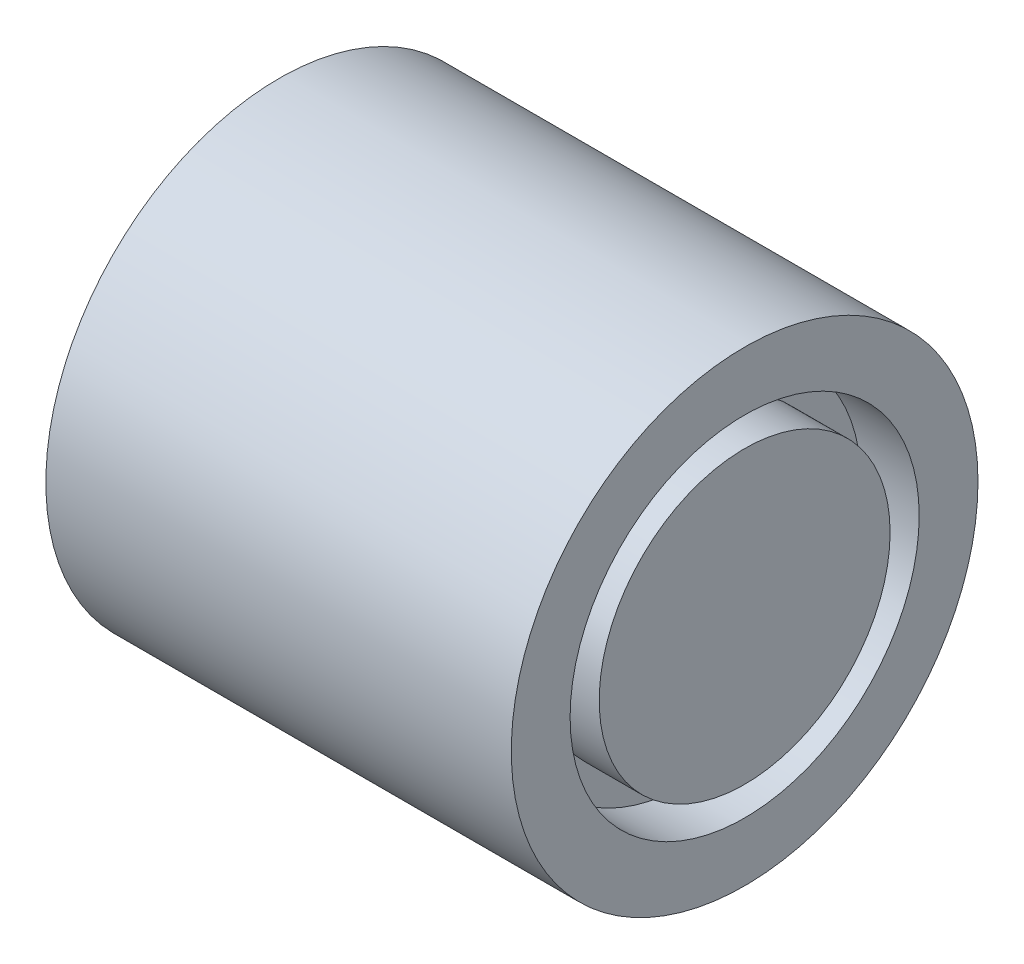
from build123d import *

# Parameters (mm, degrees)
SKETCH2_R          = 19.05
SKETCH2_R_2        = 15.875
CUT_EXTRUDE1_DEPTH = 6.35
CUT_EXTRUDE2_START = -6.35
SKETCH3_R          = 19.05
SKETCH3_R_2        = 15.875
CUT_EXTRUDE2_DEPTH = 6.35


with BuildPart() as part:
    # Sketch1 → Revolve1 (revolve)
    with BuildSketch(Plane.XY, mode=Mode.PRIVATE) as revolve1_sk:
        Polygon((0, 0.068518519), (0, 25.468518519), (-50.8, 25.468518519), (-50.8, 0), (0, 0), align=None)
    revolve(revolve1_sk.sketch.rotate(Axis((11.589606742, 0, 0), (-1, 0, 0)), 90), axis=Axis((11.589606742, 0, 0), (-1, 0, 0)))

    # Sketch2 → Cut-Extrude1 (cut)
    with BuildSketch(Plane(origin=(0, 0, 0), x_dir=(0, 0, -1), z_dir=(1, 0, 0))):
        Circle(SKETCH2_R)
        Circle(SKETCH2_R_2, mode=Mode.SUBTRACT)
    extrude(amount=-CUT_EXTRUDE1_DEPTH, mode=Mode.SUBTRACT)

    # Sketch3 → Cut-Extrude2 (cut)
    with BuildSketch(Plane.ZY.offset(50.8).offset(CUT_EXTRUDE2_START)):
        with Locations(Location((0, 0, 0), (0, 0, 180))):
            Circle(SKETCH3_R)
        with Locations(Location((0, 0, 0), (0, 0, 180))):
            Circle(SKETCH3_R_2, mode=Mode.SUBTRACT)
    extrude(amount=CUT_EXTRUDE2_DEPTH, mode=Mode.SUBTRACT)


solid = part.part
